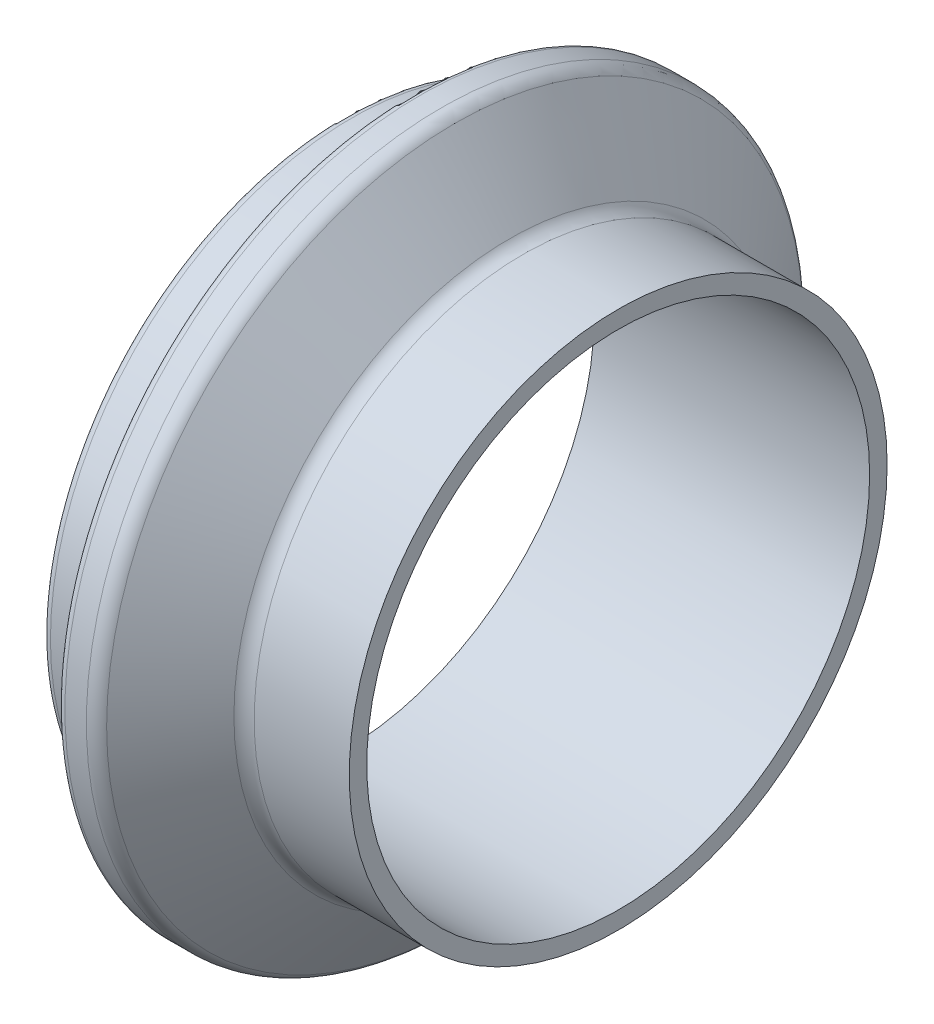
ISO-10303-21;
HEADER;
FILE_DESCRIPTION(('STEP AP214'),'2;1');
FILE_NAME('part.step','',(''),(''),'','','');
FILE_SCHEMA(('AUTOMOTIVE_DESIGN { 1 0 10303 214 1 1 1 1 }'));
ENDSEC;
DATA;
#1=APPLICATION_CONTEXT('core data for automotive mechanical design processes');
#2=APPLICATION_PROTOCOL_DEFINITION('international standard','automotive_design',2000,#1);
#3=PRODUCT_CONTEXT('',#1,'mechanical');
#4=PRODUCT('Part','Part','',(#3));
#5=PRODUCT_RELATED_PRODUCT_CATEGORY('part','',(#4));
#6=PRODUCT_DEFINITION_FORMATION('','',#4);
#7=PRODUCT_DEFINITION_CONTEXT('part definition',#1,'design');
#8=PRODUCT_DEFINITION('design','',#6,#7);
#9=PRODUCT_DEFINITION_SHAPE('','',#8);
#10=(LENGTH_UNIT() NAMED_UNIT(*) SI_UNIT(.MILLI.,.METRE.));
#11=(NAMED_UNIT(*) PLANE_ANGLE_UNIT() SI_UNIT($,.RADIAN.));
#12=(NAMED_UNIT(*) SI_UNIT($,.STERADIAN.) SOLID_ANGLE_UNIT());
#13=UNCERTAINTY_MEASURE_WITH_UNIT(LENGTH_MEASURE(1.E-05),#10,'distance_accuracy_value','');
#14=(GEOMETRIC_REPRESENTATION_CONTEXT(3) GLOBAL_UNCERTAINTY_ASSIGNED_CONTEXT((#13)) GLOBAL_UNIT_ASSIGNED_CONTEXT((#10,
#11,#12)) REPRESENTATION_CONTEXT('',''));
#15=CARTESIAN_POINT('',(0.,0.,0.));
#16=DIRECTION('',(0.,0.,1.));
#17=DIRECTION('',(1.,0.,0.));
#18=AXIS2_PLACEMENT_3D('',#15,#16,#17);
#19=CARTESIAN_POINT('',(0.,25.4,0.));
#20=DIRECTION('',(1.,0.,0.));
#21=DIRECTION('',(0.,0.,-1.));
#22=AXIS2_PLACEMENT_3D('',#19,#20,#21);
#23=PLANE('',#22);
#24=CARTESIAN_POINT('',(0.,0.,0.));
#25=DIRECTION('',(1.,0.,0.));
#26=DIRECTION('',(0.,0.,-1.));
#27=AXIS2_PLACEMENT_3D('',#24,#25,#26);
#28=CIRCLE('',#27,25.4);
#29=CARTESIAN_POINT('',(0.,0.,-25.4));
#30=VERTEX_POINT('',#29);
#31=EDGE_CURVE('E10',#30,#30,#28,.T.);
#32=ORIENTED_EDGE('',*,*,#31,.T.);
#33=EDGE_LOOP('',(#32));
#34=FACE_BOUND('',#33,.T.);
#35=CARTESIAN_POINT('',(0.,0.,0.));
#36=DIRECTION('',(1.,0.,0.));
#37=DIRECTION('',(0.,0.,-1.));
#38=AXIS2_PLACEMENT_3D('',#35,#36,#37);
#39=CIRCLE('',#38,23.749);
#40=CARTESIAN_POINT('',(0.,0.,-23.749));
#41=VERTEX_POINT('',#40);
#42=EDGE_CURVE('E73',#41,#41,#39,.T.);
#43=ORIENTED_EDGE('',*,*,#42,.F.);
#44=EDGE_LOOP('',(#43));
#45=FACE_BOUND('',#44,.T.);
#46=ADVANCED_FACE('F30',(#34,#45),#23,.T.);
#47=CARTESIAN_POINT('',(0.,0.,0.));
#48=DIRECTION('',(1.,0.,0.));
#49=DIRECTION('',(0.,0.,-1.));
#50=AXIS2_PLACEMENT_3D('',#47,#48,#49);
#51=CYLINDRICAL_SURFACE('',#50,25.4);
#52=CARTESIAN_POINT('',(-8.97768239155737,0.,0.));
#53=DIRECTION('',(1.,0.,0.));
#54=DIRECTION('',(0.,0.,-1.));
#55=AXIS2_PLACEMENT_3D('',#52,#53,#54);
#56=CIRCLE('',#55,25.4);
#57=CARTESIAN_POINT('',(-8.97768239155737,0.,-25.4));
#58=VERTEX_POINT('',#57);
#59=EDGE_CURVE('E36',#58,#58,#56,.T.);
#60=ORIENTED_EDGE('',*,*,#59,.T.);
#61=EDGE_LOOP('',(#60));
#62=FACE_BOUND('',#61,.T.);
#63=ORIENTED_EDGE('',*,*,#31,.F.);
#64=EDGE_LOOP('',(#63));
#65=FACE_BOUND('',#64,.T.);
#66=ADVANCED_FACE('F81',(#62,#65),#51,.T.);
#67=CARTESIAN_POINT('',(-8.97768239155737,0.,0.));
#68=DIRECTION('',(1.,0.,0.));
#69=DIRECTION('',(0.,0.,-1.));
#70=AXIS2_PLACEMENT_3D('',#67,#68,#69);
#71=TOROIDAL_SURFACE('',#70,27.0002,1.6002);
#72=CARTESIAN_POINT('',(-10.255658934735,0.,0.));
#73=DIRECTION('',(1.,0.,0.));
#74=DIRECTION('',(0.,0.,-1.));
#75=AXIS2_PLACEMENT_3D('',#72,#73,#74);
#76=CIRCLE('',#75,26.0371755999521);
#77=CARTESIAN_POINT('',(-10.255658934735,0.,-26.0371755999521));
#78=VERTEX_POINT('',#77);
#79=EDGE_CURVE('E40',#78,#78,#76,.T.);
#80=ORIENTED_EDGE('',*,*,#79,.T.);
#81=EDGE_LOOP('',(#80));
#82=FACE_BOUND('',#81,.T.);
#83=ORIENTED_EDGE('',*,*,#59,.F.);
#84=EDGE_LOOP('',(#83));
#85=FACE_BOUND('',#84,.T.);
#86=ADVANCED_FACE('F85',(#82,#85),#71,.F.);
#87=CARTESIAN_POINT('',(-10.255658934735,0.,0.));
#88=DIRECTION('',(-1.,0.,0.));
#89=DIRECTION('',(0.,0.,1.));
#90=AXIS2_PLACEMENT_3D('',#87,#88,#89);
#91=CONICAL_SURFACE('',#90,26.0371755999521,0.925024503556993);
#92=CARTESIAN_POINT('',(-15.4202537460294,0.,0.));
#93=DIRECTION('',(1.,0.,0.));
#94=DIRECTION('',(0.,0.,-1.));
#95=AXIS2_PLACEMENT_3D('',#92,#93,#94);
#96=CIRCLE('',#95,32.8908244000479);
#97=CARTESIAN_POINT('',(-15.4202537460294,0.,-32.8908244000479));
#98=VERTEX_POINT('',#97);
#99=EDGE_CURVE('E44',#98,#98,#96,.T.);
#100=ORIENTED_EDGE('',*,*,#99,.T.);
#101=EDGE_LOOP('',(#100));
#102=FACE_BOUND('',#101,.T.);
#103=ORIENTED_EDGE('',*,*,#79,.F.);
#104=EDGE_LOOP('',(#103));
#105=FACE_BOUND('',#104,.T.);
#106=ADVANCED_FACE('F89',(#102,#105),#91,.T.);
#107=CARTESIAN_POINT('',(-16.6982302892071,0.,0.));
#108=DIRECTION('',(1.,0.,0.));
#109=DIRECTION('',(0.,0.,-1.));
#110=AXIS2_PLACEMENT_3D('',#107,#108,#109);
#111=TOROIDAL_SURFACE('',#110,31.9278,1.6002);
#112=CARTESIAN_POINT('',(-16.6982302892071,0.,0.));
#113=DIRECTION('',(1.,0.,0.));
#114=DIRECTION('',(0.,0.,-1.));
#115=AXIS2_PLACEMENT_3D('',#112,#113,#114);
#116=CIRCLE('',#115,33.528);
#117=CARTESIAN_POINT('',(-16.6982302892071,0.,-33.528));
#118=VERTEX_POINT('',#117);
#119=EDGE_CURVE('E49',#118,#118,#116,.T.);
#120=ORIENTED_EDGE('',*,*,#119,.T.);
#121=EDGE_LOOP('',(#120));
#122=FACE_BOUND('',#121,.T.);
#123=ORIENTED_EDGE('',*,*,#99,.F.);
#124=EDGE_LOOP('',(#123));
#125=FACE_BOUND('',#124,.T.);
#126=ADVANCED_FACE('F96',(#122,#125),#111,.T.);
#127=CARTESIAN_POINT('',(0.,0.,0.));
#128=DIRECTION('',(1.,0.,0.));
#129=DIRECTION('',(0.,0.,-1.));
#130=AXIS2_PLACEMENT_3D('',#127,#128,#129);
#131=CYLINDRICAL_SURFACE('',#130,33.528);
#132=CARTESIAN_POINT('',(-18.7198,0.,0.));
#133=DIRECTION('',(1.,0.,0.));
#134=DIRECTION('',(0.,0.,-1.));
#135=AXIS2_PLACEMENT_3D('',#132,#133,#134);
#136=CIRCLE('',#135,33.528);
#137=CARTESIAN_POINT('',(-18.7198,0.,-33.528));
#138=VERTEX_POINT('',#137);
#139=EDGE_CURVE('E52',#138,#138,#136,.T.);
#140=ORIENTED_EDGE('',*,*,#139,.T.);
#141=EDGE_LOOP('',(#140));
#142=FACE_BOUND('',#141,.T.);
#143=ORIENTED_EDGE('',*,*,#119,.F.);
#144=EDGE_LOOP('',(#143));
#145=FACE_BOUND('',#144,.T.);
#146=ADVANCED_FACE('F100',(#142,#145),#131,.T.);
#147=CARTESIAN_POINT('',(-18.7198,0.,0.));
#148=DIRECTION('',(1.,0.,0.));
#149=DIRECTION('',(0.,0.,-1.));
#150=AXIS2_PLACEMENT_3D('',#147,#148,#149);
#151=TOROIDAL_SURFACE('',#150,32.7152,0.812800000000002);
#152=CARTESIAN_POINT('',(-19.5326,0.,0.));
#153=DIRECTION('',(1.,0.,0.));
#154=DIRECTION('',(0.,0.,-1.));
#155=AXIS2_PLACEMENT_3D('',#152,#153,#154);
#156=CIRCLE('',#155,32.7152);
#157=CARTESIAN_POINT('',(-19.5326,0.,-32.7152));
#158=VERTEX_POINT('',#157);
#159=EDGE_CURVE('E55',#158,#158,#156,.T.);
#160=ORIENTED_EDGE('',*,*,#159,.T.);
#161=EDGE_LOOP('',(#160));
#162=FACE_BOUND('',#161,.T.);
#163=ORIENTED_EDGE('',*,*,#139,.F.);
#164=EDGE_LOOP('',(#163));
#165=FACE_BOUND('',#164,.T.);
#166=ADVANCED_FACE('F104',(#162,#165),#151,.T.);
#167=CARTESIAN_POINT('',(-19.5326,29.2354,0.));
#168=DIRECTION('',(-1.,0.,0.));
#169=DIRECTION('',(0.,0.,1.));
#170=AXIS2_PLACEMENT_3D('',#167,#168,#169);
#171=PLANE('',#170);
#172=CARTESIAN_POINT('',(-19.5326,0.,0.));
#173=DIRECTION('',(1.,0.,0.));
#174=DIRECTION('',(0.,0.,-1.));
#175=AXIS2_PLACEMENT_3D('',#172,#173,#174);
#176=CIRCLE('',#175,29.2354);
#177=CARTESIAN_POINT('',(-19.5326,0.,-29.2354));
#178=VERTEX_POINT('',#177);
#179=EDGE_CURVE('E58',#178,#178,#176,.T.);
#180=ORIENTED_EDGE('',*,*,#179,.T.);
#181=EDGE_LOOP('',(#180));
#182=FACE_BOUND('',#181,.T.);
#183=ORIENTED_EDGE('',*,*,#159,.F.);
#184=EDGE_LOOP('',(#183));
#185=FACE_BOUND('',#184,.T.);
#186=ADVANCED_FACE('F108',(#182,#185),#171,.T.);
#187=CARTESIAN_POINT('',(-20.3454,0.,0.));
#188=DIRECTION('',(1.,0.,0.));
#189=DIRECTION('',(0.,0.,-1.));
#190=AXIS2_PLACEMENT_3D('',#187,#188,#189);
#191=TOROIDAL_SURFACE('',#190,29.2354,0.812799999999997);
#192=CARTESIAN_POINT('',(-20.3454,0.,0.));
#193=DIRECTION('',(1.,0.,0.));
#194=DIRECTION('',(0.,0.,-1.));
#195=AXIS2_PLACEMENT_3D('',#192,#193,#194);
#196=CIRCLE('',#195,28.4226);
#197=CARTESIAN_POINT('',(-20.3454,0.,-28.4226));
#198=VERTEX_POINT('',#197);
#199=EDGE_CURVE('E61',#198,#198,#196,.T.);
#200=ORIENTED_EDGE('',*,*,#199,.T.);
#201=EDGE_LOOP('',(#200));
#202=FACE_BOUND('',#201,.T.);
#203=ORIENTED_EDGE('',*,*,#179,.F.);
#204=EDGE_LOOP('',(#203));
#205=FACE_BOUND('',#204,.T.);
#206=ADVANCED_FACE('F112',(#202,#205),#191,.F.);
#207=CARTESIAN_POINT('',(0.,0.,0.));
#208=DIRECTION('',(1.,0.,0.));
#209=DIRECTION('',(0.,0.,-1.));
#210=AXIS2_PLACEMENT_3D('',#207,#208,#209);
#211=CYLINDRICAL_SURFACE('',#210,28.4226);
#212=CARTESIAN_POINT('',(-25.1968,0.,0.));
#213=DIRECTION('',(1.,0.,0.));
#214=DIRECTION('',(0.,0.,-1.));
#215=AXIS2_PLACEMENT_3D('',#212,#213,#214);
#216=CIRCLE('',#215,28.4226);
#217=CARTESIAN_POINT('',(-25.1968,0.,-28.4226));
#218=VERTEX_POINT('',#217);
#219=EDGE_CURVE('E64',#218,#218,#216,.T.);
#220=ORIENTED_EDGE('',*,*,#219,.T.);
#221=EDGE_LOOP('',(#220));
#222=FACE_BOUND('',#221,.T.);
#223=ORIENTED_EDGE('',*,*,#199,.F.);
#224=EDGE_LOOP('',(#223));
#225=FACE_BOUND('',#224,.T.);
#226=ADVANCED_FACE('F116',(#222,#225),#211,.T.);
#227=CARTESIAN_POINT('',(-25.1968,0.,0.));
#228=DIRECTION('',(1.,0.,0.));
#229=DIRECTION('',(0.,0.,-1.));
#230=AXIS2_PLACEMENT_3D('',#227,#228,#229);
#231=TOROIDAL_SURFACE('',#230,27.6098,0.812799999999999);
#232=CARTESIAN_POINT('',(-26.0096,0.,0.));
#233=DIRECTION('',(1.,0.,0.));
#234=DIRECTION('',(0.,0.,-1.));
#235=AXIS2_PLACEMENT_3D('',#232,#233,#234);
#236=CIRCLE('',#235,27.6098);
#237=CARTESIAN_POINT('',(-26.0096,0.,-27.6098));
#238=VERTEX_POINT('',#237);
#239=EDGE_CURVE('E67',#238,#238,#236,.T.);
#240=ORIENTED_EDGE('',*,*,#239,.T.);
#241=EDGE_LOOP('',(#240));
#242=FACE_BOUND('',#241,.T.);
#243=ORIENTED_EDGE('',*,*,#219,.F.);
#244=EDGE_LOOP('',(#243));
#245=FACE_BOUND('',#244,.T.);
#246=ADVANCED_FACE('F120',(#242,#245),#231,.T.);
#247=CARTESIAN_POINT('',(-26.0096,23.749,0.));
#248=DIRECTION('',(-1.,0.,0.));
#249=DIRECTION('',(0.,0.,1.));
#250=AXIS2_PLACEMENT_3D('',#247,#248,#249);
#251=PLANE('',#250);
#252=CARTESIAN_POINT('',(-26.0096,0.,0.));
#253=DIRECTION('',(1.,0.,0.));
#254=DIRECTION('',(0.,0.,-1.));
#255=AXIS2_PLACEMENT_3D('',#252,#253,#254);
#256=CIRCLE('',#255,23.749);
#257=CARTESIAN_POINT('',(-26.0096,0.,-23.749));
#258=VERTEX_POINT('',#257);
#259=EDGE_CURVE('E70',#258,#258,#256,.T.);
#260=ORIENTED_EDGE('',*,*,#259,.T.);
#261=EDGE_LOOP('',(#260));
#262=FACE_BOUND('',#261,.T.);
#263=ORIENTED_EDGE('',*,*,#239,.F.);
#264=EDGE_LOOP('',(#263));
#265=FACE_BOUND('',#264,.T.);
#266=ADVANCED_FACE('F124',(#262,#265),#251,.T.);
#267=CARTESIAN_POINT('',(0.,0.,0.));
#268=DIRECTION('',(1.,0.,0.));
#269=DIRECTION('',(0.,0.,-1.));
#270=AXIS2_PLACEMENT_3D('',#267,#268,#269);
#271=CYLINDRICAL_SURFACE('',#270,23.749);
#272=ORIENTED_EDGE('',*,*,#42,.T.);
#273=EDGE_LOOP('',(#272));
#274=FACE_BOUND('',#273,.T.);
#275=ORIENTED_EDGE('',*,*,#259,.F.);
#276=EDGE_LOOP('',(#275));
#277=FACE_BOUND('',#276,.T.);
#278=ADVANCED_FACE('F77',(#274,#277),#271,.F.);
#279=CLOSED_SHELL('',(#46,#66,#86,#106,#126,#146,#166,#186,#206,#226,#246,#266,#278));
#280=MANIFOLD_SOLID_BREP('B2',#279);
#281=ADVANCED_BREP_SHAPE_REPRESENTATION('',(#18,#280),#14);
#282=SHAPE_DEFINITION_REPRESENTATION(#9,#281);
ENDSEC;
END-ISO-10303-21;
